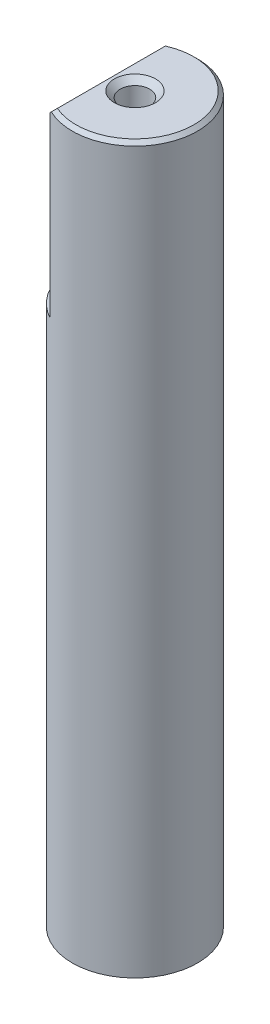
ISO-10303-21;
HEADER;
FILE_DESCRIPTION(('STEP AP214'),'2;1');
FILE_NAME('part.step','',(''),(''),'','','');
FILE_SCHEMA(('AUTOMOTIVE_DESIGN { 1 0 10303 214 1 1 1 1 }'));
ENDSEC;
DATA;
#1=APPLICATION_CONTEXT('core data for automotive mechanical design processes');
#2=APPLICATION_PROTOCOL_DEFINITION('international standard','automotive_design',2000,#1);
#3=PRODUCT_CONTEXT('',#1,'mechanical');
#4=PRODUCT('Part','Part','',(#3));
#5=PRODUCT_RELATED_PRODUCT_CATEGORY('part','',(#4));
#6=PRODUCT_DEFINITION_FORMATION('','',#4);
#7=PRODUCT_DEFINITION_CONTEXT('part definition',#1,'design');
#8=PRODUCT_DEFINITION('design','',#6,#7);
#9=PRODUCT_DEFINITION_SHAPE('','',#8);
#10=(LENGTH_UNIT() NAMED_UNIT(*) SI_UNIT(.MILLI.,.METRE.));
#11=(NAMED_UNIT(*) PLANE_ANGLE_UNIT() SI_UNIT($,.RADIAN.));
#12=(NAMED_UNIT(*) SI_UNIT($,.STERADIAN.) SOLID_ANGLE_UNIT());
#13=UNCERTAINTY_MEASURE_WITH_UNIT(LENGTH_MEASURE(1.E-05),#10,'distance_accuracy_value','');
#14=(GEOMETRIC_REPRESENTATION_CONTEXT(3) GLOBAL_UNCERTAINTY_ASSIGNED_CONTEXT((#13)) GLOBAL_UNIT_ASSIGNED_CONTEXT((#10,
#11,#12)) REPRESENTATION_CONTEXT('',''));
#15=CARTESIAN_POINT('',(0.,0.,0.));
#16=DIRECTION('',(0.,0.,1.));
#17=DIRECTION('',(1.,0.,0.));
#18=AXIS2_PLACEMENT_3D('',#15,#16,#17);
#19=CARTESIAN_POINT('',(0.,97.5,0.));
#20=DIRECTION('',(0.,-1.,0.));
#21=DIRECTION('',(0.,0.,-1.));
#22=AXIS2_PLACEMENT_3D('',#19,#20,#21);
#23=CYLINDRICAL_SURFACE('',#22,8.5);
#24=DIRECTION('',(0.,1.,0.));
#25=VECTOR('',#24,1.);
#26=CARTESIAN_POINT('',(-4.,73.3,-7.5));
#27=LINE('',#26,#25);
#28=CARTESIAN_POINT('',(-4.,73.3,-7.5));
#29=VERTEX_POINT('',#28);
#30=CARTESIAN_POINT('',(-4.,97.5,-7.5));
#31=VERTEX_POINT('',#30);
#32=EDGE_CURVE('E100',#29,#31,#27,.T.);
#33=ORIENTED_EDGE('',*,*,#32,.T.);
#34=CARTESIAN_POINT('',(0.,101.5,0.));
#35=DIRECTION('',(-0.707106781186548,0.707106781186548,0.));
#36=DIRECTION('',(-0.707106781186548,-0.707106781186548,0.));
#37=AXIS2_PLACEMENT_3D('',#34,#35,#36);
#38=ELLIPSE('',#37,12.0208152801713,8.5);
#39=CARTESIAN_POINT('',(-3.69999999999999,97.8,-7.6524505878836));
#40=VERTEX_POINT('',#39);
#41=EDGE_CURVE('E142',#31,#40,#38,.F.);
#42=ORIENTED_EDGE('',*,*,#41,.T.);
#43=CARTESIAN_POINT('',(0.,97.8,0.));
#44=DIRECTION('',(0.,-1.,0.));
#45=DIRECTION('',(0.,0.,-1.));
#46=AXIS2_PLACEMENT_3D('',#43,#44,#45);
#47=CIRCLE('',#46,8.5);
#48=CARTESIAN_POINT('',(-3.7,97.8,7.6524505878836));
#49=VERTEX_POINT('',#48);
#50=EDGE_CURVE('E130',#40,#49,#47,.T.);
#51=ORIENTED_EDGE('',*,*,#50,.T.);
#52=CARTESIAN_POINT('',(0.,101.5,0.));
#53=DIRECTION('',(-0.707106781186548,0.707106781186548,0.));
#54=DIRECTION('',(-0.707106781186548,-0.707106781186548,0.));
#55=AXIS2_PLACEMENT_3D('',#52,#53,#54);
#56=ELLIPSE('',#55,12.0208152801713,8.5);
#57=CARTESIAN_POINT('',(-4.,97.5,7.5));
#58=VERTEX_POINT('',#57);
#59=EDGE_CURVE('E139',#49,#58,#56,.F.);
#60=ORIENTED_EDGE('',*,*,#59,.T.);
#61=DIRECTION('',(0.,1.,0.));
#62=VECTOR('',#61,1.);
#63=CARTESIAN_POINT('',(-4.,73.3,7.5));
#64=LINE('',#63,#62);
#65=CARTESIAN_POINT('',(-4.,73.3,7.5));
#66=VERTEX_POINT('',#65);
#67=EDGE_CURVE('E106',#66,#58,#64,.T.);
#68=ORIENTED_EDGE('',*,*,#67,.F.);
#69=CARTESIAN_POINT('',(0.,73.3,0.));
#70=DIRECTION('',(0.,1.,0.));
#71=DIRECTION('',(0.,0.,1.));
#72=AXIS2_PLACEMENT_3D('',#69,#70,#71);
#73=CIRCLE('',#72,8.5);
#74=EDGE_CURVE('E92',#29,#66,#73,.T.);
#75=ORIENTED_EDGE('',*,*,#74,.F.);
#76=EDGE_LOOP('',(#33,#42,#51,#60,#68,#75));
#77=FACE_BOUND('',#76,.T.);
#78=CARTESIAN_POINT('',(0.,0.,0.));
#79=DIRECTION('',(0.,1.,0.));
#80=DIRECTION('',(0.,0.,1.));
#81=AXIS2_PLACEMENT_3D('',#78,#79,#80);
#82=CIRCLE('',#81,8.5);
#83=CARTESIAN_POINT('',(0.,0.,8.5));
#84=VERTEX_POINT('',#83);
#85=EDGE_CURVE('E126',#84,#84,#82,.T.);
#86=ORIENTED_EDGE('',*,*,#85,.T.);
#87=EDGE_LOOP('',(#86));
#88=FACE_BOUND('',#87,.T.);
#89=ADVANCED_FACE('F47',(#77,#88),#23,.T.);
#90=CARTESIAN_POINT('',(0.,0.,0.));
#91=DIRECTION('',(0.,1.,0.));
#92=DIRECTION('',(0.,0.,1.));
#93=AXIS2_PLACEMENT_3D('',#90,#91,#92);
#94=PLANE('',#93);
#95=ORIENTED_EDGE('',*,*,#85,.F.);
#96=EDGE_LOOP('',(#95));
#97=FACE_BOUND('',#96,.T.);
#98=ADVANCED_FACE('F184',(#97),#94,.F.);
#99=CARTESIAN_POINT('',(0.,98.3,0.));
#100=DIRECTION('',(0.,1.,0.));
#101=DIRECTION('',(0.,0.,1.));
#102=AXIS2_PLACEMENT_3D('',#99,#100,#101);
#103=PLANE('',#102);
#104=CARTESIAN_POINT('',(0.,98.3,0.));
#105=DIRECTION('',(0.,1.,0.));
#106=DIRECTION('',(0.,0.,1.));
#107=AXIS2_PLACEMENT_3D('',#104,#105,#106);
#108=CIRCLE('',#107,8.);
#109=CARTESIAN_POINT('',(-3.20000000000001,98.3,7.33212111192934));
#110=VERTEX_POINT('',#109);
#111=CARTESIAN_POINT('',(-3.20000000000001,98.3,-7.33212111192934));
#112=VERTEX_POINT('',#111);
#113=EDGE_CURVE('E123',#110,#112,#108,.T.);
#114=ORIENTED_EDGE('',*,*,#113,.T.);
#115=DIRECTION('',(0.,0.,1.));
#116=VECTOR('',#115,1.);
#117=CARTESIAN_POINT('',(-3.20000000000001,98.3,6.92820323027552));
#118=LINE('',#117,#116);
#119=EDGE_CURVE('E11',#112,#110,#118,.T.);
#120=ORIENTED_EDGE('',*,*,#119,.T.);
#121=EDGE_LOOP('',(#114,#120));
#122=FACE_BOUND('',#121,.T.);
#123=CARTESIAN_POINT('',(0.,98.3,0.));
#124=DIRECTION('',(0.,1.,0.));
#125=DIRECTION('',(0.,0.,1.));
#126=AXIS2_PLACEMENT_3D('',#123,#124,#125);
#127=CIRCLE('',#126,2.8);
#128=CARTESIAN_POINT('',(0.,98.3,2.8));
#129=VERTEX_POINT('',#128);
#130=EDGE_CURVE('E113',#129,#129,#127,.T.);
#131=ORIENTED_EDGE('',*,*,#130,.F.);
#132=EDGE_LOOP('',(#131));
#133=FACE_BOUND('',#132,.T.);
#134=ADVANCED_FACE('F165',(#122,#133),#103,.T.);
#135=CARTESIAN_POINT('',(0.,98.3,0.));
#136=DIRECTION('',(0.,-1.,0.));
#137=DIRECTION('',(0.,0.,-1.));
#138=AXIS2_PLACEMENT_3D('',#135,#136,#137);
#139=CONICAL_SURFACE('',#138,8.,0.785398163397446);
#140=ORIENTED_EDGE('',*,*,#50,.F.);
#141=CARTESIAN_POINT('',(-3.69999999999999,97.8,-7.6524505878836));
#142=CARTESIAN_POINT('',(-3.61636339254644,97.8836366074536,-7.60000925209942));
#143=CARTESIAN_POINT('',(-3.53287844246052,97.9671215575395,-7.54709447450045));
#144=CARTESIAN_POINT('',(-3.36621177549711,98.1337882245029,-7.44031798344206));
#145=CARTESIAN_POINT('',(-3.28303005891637,98.2169699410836,-7.38645626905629));
#146=CARTESIAN_POINT('',(-3.19999999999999,98.3,-7.33212111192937));
#147=B_SPLINE_CURVE_WITH_KNOTS('',3,(#141,#142,#143,#144,#145,#146),.UNSPECIFIED.,.F.,.F.,(4,2,
4),(0.,0.38814304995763,0.776286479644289),.UNSPECIFIED.);
#148=EDGE_CURVE('E58',#40,#112,#147,.T.);
#149=ORIENTED_EDGE('',*,*,#148,.T.);
#150=ORIENTED_EDGE('',*,*,#113,.F.);
#151=CARTESIAN_POINT('',(-3.20000000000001,98.3,7.33212111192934));
#152=CARTESIAN_POINT('',(-3.28303005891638,98.2169699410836,7.38645626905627));
#153=CARTESIAN_POINT('',(-3.36621177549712,98.1337882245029,7.44031798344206));
#154=CARTESIAN_POINT('',(-3.53287844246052,97.9671215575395,7.54709447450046));
#155=CARTESIAN_POINT('',(-3.61636339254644,97.8836366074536,7.60000925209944));
#156=CARTESIAN_POINT('',(-3.69999999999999,97.8,7.65245058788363));
#157=B_SPLINE_CURVE_WITH_KNOTS('',3,(#151,#152,#153,#154,#155,#156),.UNSPECIFIED.,.F.,.F.,(4,2,
4),(0.,0.388143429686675,0.776286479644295),.UNSPECIFIED.);
#158=EDGE_CURVE('E145',#110,#49,#157,.T.);
#159=ORIENTED_EDGE('',*,*,#158,.T.);
#160=EDGE_LOOP('',(#140,#149,#150,#159));
#161=FACE_BOUND('',#160,.T.);
#162=ADVANCED_FACE('F157',(#161),#139,.T.);
#163=CARTESIAN_POINT('',(0.,79.3,0.));
#164=DIRECTION('',(0.,1.,0.));
#165=DIRECTION('',(0.,0.,1.));
#166=AXIS2_PLACEMENT_3D('',#163,#164,#165);
#167=PLANE('',#166);
#168=CARTESIAN_POINT('',(0.,79.3,0.));
#169=DIRECTION('',(0.,1.,0.));
#170=DIRECTION('',(0.,0.,1.));
#171=AXIS2_PLACEMENT_3D('',#168,#169,#170);
#172=CIRCLE('',#171,2.);
#173=CARTESIAN_POINT('',(0.,79.3,2.));
#174=VERTEX_POINT('',#173);
#175=EDGE_CURVE('E119',#174,#174,#172,.T.);
#176=ORIENTED_EDGE('',*,*,#175,.T.);
#177=EDGE_LOOP('',(#176));
#178=FACE_BOUND('',#177,.T.);
#179=ADVANCED_FACE('F164',(#178),#167,.T.);
#180=CARTESIAN_POINT('',(0.,79.3,0.));
#181=DIRECTION('',(0.,1.,0.));
#182=DIRECTION('',(0.,0.,1.));
#183=AXIS2_PLACEMENT_3D('',#180,#181,#182);
#184=CYLINDRICAL_SURFACE('',#183,2.);
#185=ORIENTED_EDGE('',*,*,#175,.F.);
#186=EDGE_LOOP('',(#185));
#187=FACE_BOUND('',#186,.T.);
#188=CARTESIAN_POINT('',(0.,97.5,0.));
#189=DIRECTION('',(0.,1.,0.));
#190=DIRECTION('',(0.,0.,1.));
#191=AXIS2_PLACEMENT_3D('',#188,#189,#190);
#192=CIRCLE('',#191,2.);
#193=CARTESIAN_POINT('',(0.,97.5,2.));
#194=VERTEX_POINT('',#193);
#195=EDGE_CURVE('E118',#194,#194,#192,.F.);
#196=ORIENTED_EDGE('',*,*,#195,.F.);
#197=EDGE_LOOP('',(#196));
#198=FACE_BOUND('',#197,.T.);
#199=ADVANCED_FACE('F172',(#187,#198),#184,.F.);
#200=CARTESIAN_POINT('',(0.,97.5,0.));
#201=DIRECTION('',(0.,1.,0.));
#202=DIRECTION('',(0.,0.,1.));
#203=AXIS2_PLACEMENT_3D('',#200,#201,#202);
#204=CONICAL_SURFACE('',#203,2.,0.785398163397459);
#205=ORIENTED_EDGE('',*,*,#130,.T.);
#206=EDGE_LOOP('',(#205));
#207=FACE_BOUND('',#206,.T.);
#208=ORIENTED_EDGE('',*,*,#195,.T.);
#209=EDGE_LOOP('',(#208));
#210=FACE_BOUND('',#209,.T.);
#211=ADVANCED_FACE('F167',(#207,#210),#204,.F.);
#212=CARTESIAN_POINT('',(-4.,73.3,0.));
#213=DIRECTION('',(1.,0.,0.));
#214=DIRECTION('',(0.,0.,-1.));
#215=AXIS2_PLACEMENT_3D('',#212,#213,#214);
#216=PLANE('',#215);
#217=ORIENTED_EDGE('',*,*,#67,.T.);
#218=DIRECTION('',(0.,0.,-1.));
#219=VECTOR('',#218,1.);
#220=CARTESIAN_POINT('',(-4.,97.5,-6.92820323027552));
#221=LINE('',#220,#219);
#222=EDGE_CURVE('E103',#58,#31,#221,.T.);
#223=ORIENTED_EDGE('',*,*,#222,.T.);
#224=ORIENTED_EDGE('',*,*,#32,.F.);
#225=DIRECTION('',(0.,0.,-1.));
#226=VECTOR('',#225,1.);
#227=CARTESIAN_POINT('',(-4.,73.3,0.));
#228=LINE('',#227,#226);
#229=EDGE_CURVE('E88',#66,#29,#228,.T.);
#230=ORIENTED_EDGE('',*,*,#229,.F.);
#231=EDGE_LOOP('',(#217,#223,#224,#230));
#232=FACE_BOUND('',#231,.T.);
#233=ADVANCED_FACE('F101',(#232),#216,.F.);
#234=CARTESIAN_POINT('',(0.,73.3,0.));
#235=DIRECTION('',(0.,1.,0.));
#236=DIRECTION('',(0.,0.,1.));
#237=AXIS2_PLACEMENT_3D('',#234,#235,#236);
#238=PLANE('',#237);
#239=ORIENTED_EDGE('',*,*,#229,.T.);
#240=ORIENTED_EDGE('',*,*,#74,.T.);
#241=EDGE_LOOP('',(#239,#240));
#242=FACE_BOUND('',#241,.T.);
#243=ADVANCED_FACE('F90',(#242),#238,.T.);
#244=CARTESIAN_POINT('',(-4.,97.5,0.));
#245=DIRECTION('',(-0.707106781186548,0.707106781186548,0.));
#246=DIRECTION('',(0.,0.,1.));
#247=AXIS2_PLACEMENT_3D('',#244,#245,#246);
#248=PLANE('',#247);
#249=ORIENTED_EDGE('',*,*,#158,.F.);
#250=ORIENTED_EDGE('',*,*,#119,.F.);
#251=ORIENTED_EDGE('',*,*,#148,.F.);
#252=ORIENTED_EDGE('',*,*,#41,.F.);
#253=ORIENTED_EDGE('',*,*,#222,.F.);
#254=ORIENTED_EDGE('',*,*,#59,.F.);
#255=EDGE_LOOP('',(#249,#250,#251,#252,#253,#254));
#256=FACE_BOUND('',#255,.T.);
#257=ADVANCED_FACE('F50',(#256),#248,.T.);
#258=CLOSED_SHELL('',(#89,#98,#134,#162,#179,#199,#211,#233,#243,#257));
#259=MANIFOLD_SOLID_BREP('B2',#258);
#260=ADVANCED_BREP_SHAPE_REPRESENTATION('',(#18,#259),#14);
#261=SHAPE_DEFINITION_REPRESENTATION(#9,#260);
ENDSEC;
END-ISO-10303-21;
